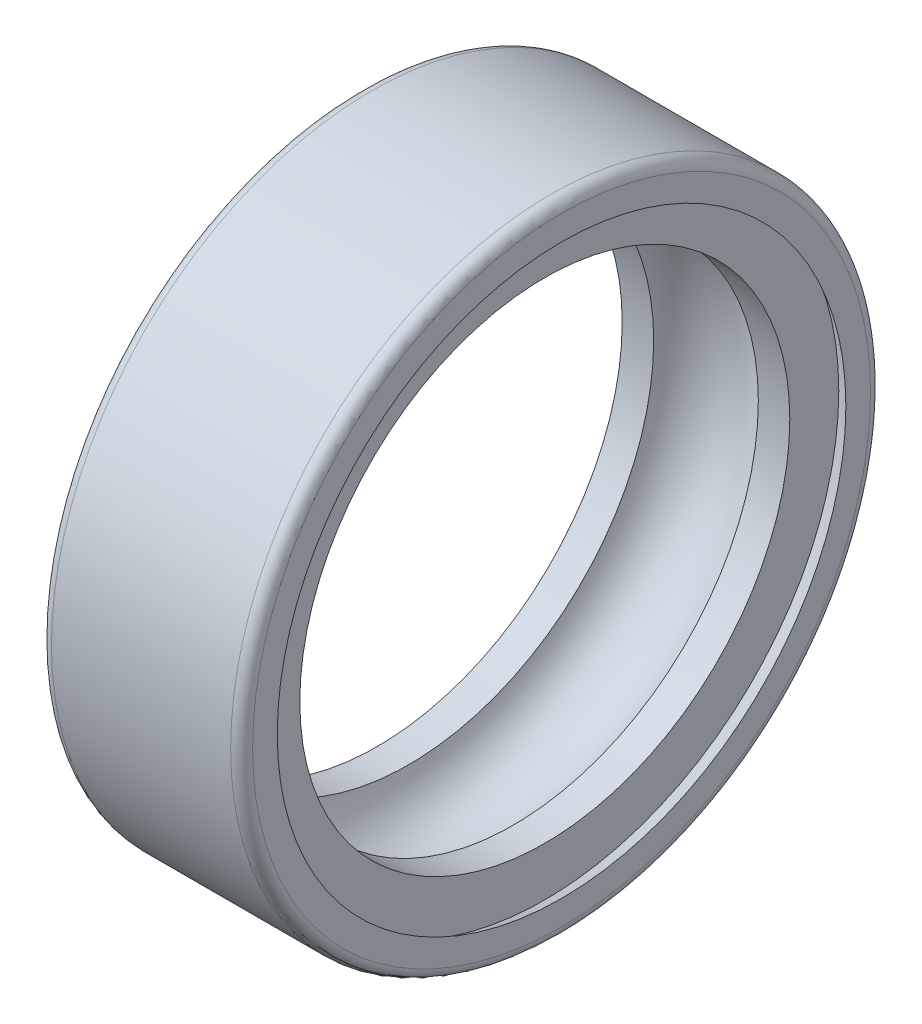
ISO-10303-21;
HEADER;
FILE_DESCRIPTION(('STEP AP214'),'2;1');
FILE_NAME('part.step','',(''),(''),'','','');
FILE_SCHEMA(('AUTOMOTIVE_DESIGN { 1 0 10303 214 1 1 1 1 }'));
ENDSEC;
DATA;
#1=APPLICATION_CONTEXT('core data for automotive mechanical design processes');
#2=APPLICATION_PROTOCOL_DEFINITION('international standard','automotive_design',2000,#1);
#3=PRODUCT_CONTEXT('',#1,'mechanical');
#4=PRODUCT('Part','Part','',(#3));
#5=PRODUCT_RELATED_PRODUCT_CATEGORY('part','',(#4));
#6=PRODUCT_DEFINITION_FORMATION('','',#4);
#7=PRODUCT_DEFINITION_CONTEXT('part definition',#1,'design');
#8=PRODUCT_DEFINITION('design','',#6,#7);
#9=PRODUCT_DEFINITION_SHAPE('','',#8);
#10=(LENGTH_UNIT() NAMED_UNIT(*) SI_UNIT(.MILLI.,.METRE.));
#11=(NAMED_UNIT(*) PLANE_ANGLE_UNIT() SI_UNIT($,.RADIAN.));
#12=(NAMED_UNIT(*) SI_UNIT($,.STERADIAN.) SOLID_ANGLE_UNIT());
#13=UNCERTAINTY_MEASURE_WITH_UNIT(LENGTH_MEASURE(1.E-05),#10,'distance_accuracy_value','');
#14=(GEOMETRIC_REPRESENTATION_CONTEXT(3) GLOBAL_UNCERTAINTY_ASSIGNED_CONTEXT((#13)) GLOBAL_UNIT_ASSIGNED_CONTEXT((#10,
#11,#12)) REPRESENTATION_CONTEXT('',''));
#15=CARTESIAN_POINT('',(0.,0.,0.));
#16=DIRECTION('',(0.,0.,1.));
#17=DIRECTION('',(1.,0.,0.));
#18=AXIS2_PLACEMENT_3D('',#15,#16,#17);
#19=CARTESIAN_POINT('',(0.,0.,0.));
#20=DIRECTION('',(-1.,0.,0.));
#21=DIRECTION('',(0.,0.,1.));
#22=AXIS2_PLACEMENT_3D('',#19,#20,#21);
#23=CYLINDRICAL_SURFACE('',#22,13.4);
#24=CARTESIAN_POINT('',(10.0833333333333,0.,0.));
#25=DIRECTION('',(-1.,0.,0.));
#26=DIRECTION('',(0.,0.,1.));
#27=AXIS2_PLACEMENT_3D('',#24,#25,#26);
#28=CIRCLE('',#27,13.4);
#29=CARTESIAN_POINT('',(10.0833333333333,0.,13.4));
#30=VERTEX_POINT('',#29);
#31=EDGE_CURVE('E10',#30,#30,#28,.T.);
#32=ORIENTED_EDGE('',*,*,#31,.F.);
#33=EDGE_LOOP('',(#32));
#34=FACE_BOUND('',#33,.T.);
#35=CARTESIAN_POINT('',(8.36181760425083,0.,0.));
#36=DIRECTION('',(-1.,0.,0.));
#37=DIRECTION('',(0.,0.,1.));
#38=AXIS2_PLACEMENT_3D('',#35,#36,#37);
#39=CIRCLE('',#38,13.4);
#40=CARTESIAN_POINT('',(8.36181760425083,0.,13.4));
#41=VERTEX_POINT('',#40);
#42=EDGE_CURVE('E68',#41,#41,#39,.T.);
#43=ORIENTED_EDGE('',*,*,#42,.T.);
#44=EDGE_LOOP('',(#43));
#45=FACE_BOUND('',#44,.T.);
#46=ADVANCED_FACE('F28',(#34,#45),#23,.F.);
#47=CARTESIAN_POINT('',(10.0833333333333,13.4,0.));
#48=DIRECTION('',(-1.,0.,0.));
#49=DIRECTION('',(0.,0.,1.));
#50=AXIS2_PLACEMENT_3D('',#47,#48,#49);
#51=PLANE('',#50);
#52=CARTESIAN_POINT('',(10.0833333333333,0.,0.));
#53=DIRECTION('',(-1.,0.,0.));
#54=DIRECTION('',(0.,0.,1.));
#55=AXIS2_PLACEMENT_3D('',#52,#53,#54);
#56=CIRCLE('',#55,16.079237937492);
#57=CARTESIAN_POINT('',(10.0833333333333,0.,16.079237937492));
#58=VERTEX_POINT('',#57);
#59=EDGE_CURVE('E34',#58,#58,#56,.T.);
#60=ORIENTED_EDGE('',*,*,#59,.F.);
#61=EDGE_LOOP('',(#60));
#62=FACE_BOUND('',#61,.T.);
#63=ORIENTED_EDGE('',*,*,#31,.T.);
#64=EDGE_LOOP('',(#63));
#65=FACE_BOUND('',#64,.T.);
#66=ADVANCED_FACE('F85',(#62,#65),#51,.F.);
#67=CARTESIAN_POINT('',(10.0833333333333,0.,0.));
#68=DIRECTION('',(-1.,0.,0.));
#69=DIRECTION('',(0.,0.,1.));
#70=AXIS2_PLACEMENT_3D('',#67,#68,#69);
#71=CONICAL_SURFACE('',#70,16.079237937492,0.523598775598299);
#72=CARTESIAN_POINT('',(11.,0.,0.));
#73=DIRECTION('',(-1.,0.,0.));
#74=DIRECTION('',(0.,0.,1.));
#75=AXIS2_PLACEMENT_3D('',#72,#73,#74);
#76=CIRCLE('',#75,15.5500001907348);
#77=CARTESIAN_POINT('',(11.,0.,15.5500001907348));
#78=VERTEX_POINT('',#77);
#79=EDGE_CURVE('E38',#78,#78,#76,.T.);
#80=ORIENTED_EDGE('',*,*,#79,.F.);
#81=EDGE_LOOP('',(#80));
#82=FACE_BOUND('',#81,.T.);
#83=ORIENTED_EDGE('',*,*,#59,.T.);
#84=EDGE_LOOP('',(#83));
#85=FACE_BOUND('',#84,.T.);
#86=ADVANCED_FACE('F90',(#82,#85),#71,.F.);
#87=CARTESIAN_POINT('',(11.,15.5500001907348,0.));
#88=DIRECTION('',(-1.,0.,0.));
#89=DIRECTION('',(0.,0.,1.));
#90=AXIS2_PLACEMENT_3D('',#87,#88,#89);
#91=PLANE('',#90);
#92=CARTESIAN_POINT('',(11.,0.,0.));
#93=DIRECTION('',(-1.,0.,0.));
#94=DIRECTION('',(0.,0.,1.));
#95=AXIS2_PLACEMENT_3D('',#92,#93,#94);
#96=CIRCLE('',#95,16.8999999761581);
#97=CARTESIAN_POINT('',(11.,0.,16.8999999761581));
#98=VERTEX_POINT('',#97);
#99=EDGE_CURVE('E42',#98,#98,#96,.T.);
#100=ORIENTED_EDGE('',*,*,#99,.F.);
#101=EDGE_LOOP('',(#100));
#102=FACE_BOUND('',#101,.T.);
#103=ORIENTED_EDGE('',*,*,#79,.T.);
#104=EDGE_LOOP('',(#103));
#105=FACE_BOUND('',#104,.T.);
#106=ADVANCED_FACE('F95',(#102,#105),#91,.F.);
#107=CARTESIAN_POINT('',(10.3999999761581,0.,0.));
#108=DIRECTION('',(-1.,0.,0.));
#109=DIRECTION('',(0.,0.,1.));
#110=AXIS2_PLACEMENT_3D('',#107,#108,#109);
#111=TOROIDAL_SURFACE('',#110,16.8999999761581,0.600000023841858);
#112=CARTESIAN_POINT('',(10.3999999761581,0.,0.));
#113=DIRECTION('',(-1.,0.,0.));
#114=DIRECTION('',(0.,0.,1.));
#115=AXIS2_PLACEMENT_3D('',#112,#113,#114);
#116=CIRCLE('',#115,17.5);
#117=CARTESIAN_POINT('',(10.3999999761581,0.,17.5));
#118=VERTEX_POINT('',#117);
#119=EDGE_CURVE('E47',#118,#118,#116,.T.);
#120=ORIENTED_EDGE('',*,*,#119,.F.);
#121=EDGE_LOOP('',(#120));
#122=FACE_BOUND('',#121,.T.);
#123=ORIENTED_EDGE('',*,*,#99,.T.);
#124=EDGE_LOOP('',(#123));
#125=FACE_BOUND('',#124,.T.);
#126=ADVANCED_FACE('F101',(#122,#125),#111,.T.);
#127=CARTESIAN_POINT('',(0.,0.,0.));
#128=DIRECTION('',(-1.,0.,0.));
#129=DIRECTION('',(0.,0.,1.));
#130=AXIS2_PLACEMENT_3D('',#127,#128,#129);
#131=CYLINDRICAL_SURFACE('',#130,17.5);
#132=CARTESIAN_POINT('',(0.600000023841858,0.,0.));
#133=DIRECTION('',(-1.,0.,0.));
#134=DIRECTION('',(0.,0.,1.));
#135=AXIS2_PLACEMENT_3D('',#132,#133,#134);
#136=CIRCLE('',#135,17.5);
#137=CARTESIAN_POINT('',(0.600000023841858,0.,17.5));
#138=VERTEX_POINT('',#137);
#139=EDGE_CURVE('E50',#138,#138,#136,.T.);
#140=ORIENTED_EDGE('',*,*,#139,.F.);
#141=EDGE_LOOP('',(#140));
#142=FACE_BOUND('',#141,.T.);
#143=ORIENTED_EDGE('',*,*,#119,.T.);
#144=EDGE_LOOP('',(#143));
#145=FACE_BOUND('',#144,.T.);
#146=ADVANCED_FACE('F105',(#142,#145),#131,.T.);
#147=CARTESIAN_POINT('',(0.600000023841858,0.,0.));
#148=DIRECTION('',(-1.,0.,0.));
#149=DIRECTION('',(0.,0.,1.));
#150=AXIS2_PLACEMENT_3D('',#147,#148,#149);
#151=TOROIDAL_SURFACE('',#150,16.8999999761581,0.600000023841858);
#152=CARTESIAN_POINT('',(0.,0.,0.));
#153=DIRECTION('',(-1.,0.,0.));
#154=DIRECTION('',(0.,0.,1.));
#155=AXIS2_PLACEMENT_3D('',#152,#153,#154);
#156=CIRCLE('',#155,16.8999999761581);
#157=CARTESIAN_POINT('',(0.,0.,16.8999999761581));
#158=VERTEX_POINT('',#157);
#159=EDGE_CURVE('E53',#158,#158,#156,.T.);
#160=ORIENTED_EDGE('',*,*,#159,.F.);
#161=EDGE_LOOP('',(#160));
#162=FACE_BOUND('',#161,.T.);
#163=ORIENTED_EDGE('',*,*,#139,.T.);
#164=EDGE_LOOP('',(#163));
#165=FACE_BOUND('',#164,.T.);
#166=ADVANCED_FACE('F109',(#162,#165),#151,.T.);
#167=CARTESIAN_POINT('',(0.,16.8999999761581,0.));
#168=DIRECTION('',(1.,0.,0.));
#169=DIRECTION('',(0.,0.,-1.));
#170=AXIS2_PLACEMENT_3D('',#167,#168,#169);
#171=PLANE('',#170);
#172=CARTESIAN_POINT('',(0.,0.,0.));
#173=DIRECTION('',(-1.,0.,0.));
#174=DIRECTION('',(0.,0.,1.));
#175=AXIS2_PLACEMENT_3D('',#172,#173,#174);
#176=CIRCLE('',#175,15.5500001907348);
#177=CARTESIAN_POINT('',(0.,0.,15.5500001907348));
#178=VERTEX_POINT('',#177);
#179=EDGE_CURVE('E56',#178,#178,#176,.T.);
#180=ORIENTED_EDGE('',*,*,#179,.F.);
#181=EDGE_LOOP('',(#180));
#182=FACE_BOUND('',#181,.T.);
#183=ORIENTED_EDGE('',*,*,#159,.T.);
#184=EDGE_LOOP('',(#183));
#185=FACE_BOUND('',#184,.T.);
#186=ADVANCED_FACE('F113',(#182,#185),#171,.F.);
#187=CARTESIAN_POINT('',(0.,0.,0.));
#188=DIRECTION('',(1.,0.,0.));
#189=DIRECTION('',(0.,0.,-1.));
#190=AXIS2_PLACEMENT_3D('',#187,#188,#189);
#191=CONICAL_SURFACE('',#190,15.5500001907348,0.523598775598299);
#192=CARTESIAN_POINT('',(0.916666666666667,0.,0.));
#193=DIRECTION('',(-1.,0.,0.));
#194=DIRECTION('',(0.,0.,1.));
#195=AXIS2_PLACEMENT_3D('',#192,#193,#194);
#196=CIRCLE('',#195,16.079237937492);
#197=CARTESIAN_POINT('',(0.916666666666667,0.,16.079237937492));
#198=VERTEX_POINT('',#197);
#199=EDGE_CURVE('E59',#198,#198,#196,.T.);
#200=ORIENTED_EDGE('',*,*,#199,.F.);
#201=EDGE_LOOP('',(#200));
#202=FACE_BOUND('',#201,.T.);
#203=ORIENTED_EDGE('',*,*,#179,.T.);
#204=EDGE_LOOP('',(#203));
#205=FACE_BOUND('',#204,.T.);
#206=ADVANCED_FACE('F117',(#202,#205),#191,.F.);
#207=CARTESIAN_POINT('',(0.916666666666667,16.079237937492,0.));
#208=DIRECTION('',(1.,0.,0.));
#209=DIRECTION('',(0.,0.,-1.));
#210=AXIS2_PLACEMENT_3D('',#207,#208,#209);
#211=PLANE('',#210);
#212=CARTESIAN_POINT('',(0.916666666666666,0.,0.));
#213=DIRECTION('',(-1.,0.,0.));
#214=DIRECTION('',(0.,0.,1.));
#215=AXIS2_PLACEMENT_3D('',#212,#213,#214);
#216=CIRCLE('',#215,13.4);
#217=CARTESIAN_POINT('',(0.916666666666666,0.,13.4));
#218=VERTEX_POINT('',#217);
#219=EDGE_CURVE('E62',#218,#218,#216,.T.);
#220=ORIENTED_EDGE('',*,*,#219,.F.);
#221=EDGE_LOOP('',(#220));
#222=FACE_BOUND('',#221,.T.);
#223=ORIENTED_EDGE('',*,*,#199,.T.);
#224=EDGE_LOOP('',(#223));
#225=FACE_BOUND('',#224,.T.);
#226=ADVANCED_FACE('F81',(#222,#225),#211,.F.);
#227=CARTESIAN_POINT('',(0.,0.,0.));
#228=DIRECTION('',(-1.,0.,0.));
#229=DIRECTION('',(0.,0.,1.));
#230=AXIS2_PLACEMENT_3D('',#227,#228,#229);
#231=CYLINDRICAL_SURFACE('',#230,13.4);
#232=CARTESIAN_POINT('',(2.63818239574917,0.,0.));
#233=DIRECTION('',(-1.,0.,0.));
#234=DIRECTION('',(0.,0.,1.));
#235=AXIS2_PLACEMENT_3D('',#232,#233,#234);
#236=CIRCLE('',#235,13.4);
#237=CARTESIAN_POINT('',(2.63818239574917,0.,13.4));
#238=VERTEX_POINT('',#237);
#239=EDGE_CURVE('E65',#238,#238,#236,.T.);
#240=ORIENTED_EDGE('',*,*,#239,.F.);
#241=EDGE_LOOP('',(#240));
#242=FACE_BOUND('',#241,.T.);
#243=ORIENTED_EDGE('',*,*,#219,.T.);
#244=EDGE_LOOP('',(#243));
#245=FACE_BOUND('',#244,.T.);
#246=ADVANCED_FACE('F75',(#242,#245),#231,.F.);
#247=CARTESIAN_POINT('',(5.5,0.,0.));
#248=DIRECTION('',(-1.,0.,0.));
#249=DIRECTION('',(0.,0.,1.));
#250=AXIS2_PLACEMENT_3D('',#247,#248,#249);
#251=TOROIDAL_SURFACE('',#250,12.5,3.);
#252=ORIENTED_EDGE('',*,*,#239,.T.);
#253=EDGE_LOOP('',(#252));
#254=FACE_BOUND('',#253,.T.);
#255=ORIENTED_EDGE('',*,*,#42,.F.);
#256=EDGE_LOOP('',(#255));
#257=FACE_BOUND('',#256,.T.);
#258=ADVANCED_FACE('F73',(#254,#257),#251,.F.);
#259=CLOSED_SHELL('',(#46,#66,#86,#106,#126,#146,#166,#186,#206,#226,#246,#258));
#260=MANIFOLD_SOLID_BREP('B2',#259);
#261=ADVANCED_BREP_SHAPE_REPRESENTATION('',(#18,#260),#14);
#262=SHAPE_DEFINITION_REPRESENTATION(#9,#261);
ENDSEC;
END-ISO-10303-21;
